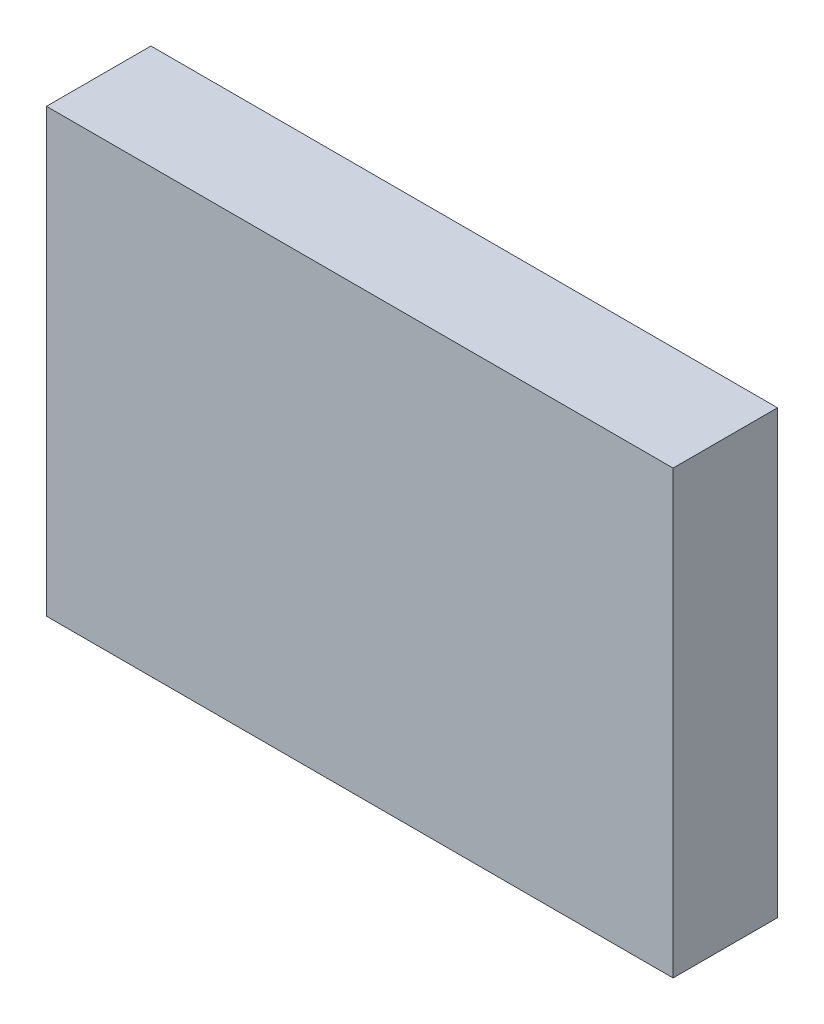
ISO-10303-21;
HEADER;
FILE_DESCRIPTION(('STEP AP214'),'2;1');
FILE_NAME('part.step','',(''),(''),'','','');
FILE_SCHEMA(('AUTOMOTIVE_DESIGN { 1 0 10303 214 1 1 1 1 }'));
ENDSEC;
DATA;
#1=APPLICATION_CONTEXT('core data for automotive mechanical design processes');
#2=APPLICATION_PROTOCOL_DEFINITION('international standard','automotive_design',2000,#1);
#3=PRODUCT_CONTEXT('',#1,'mechanical');
#4=PRODUCT('Part','Part','',(#3));
#5=PRODUCT_RELATED_PRODUCT_CATEGORY('part','',(#4));
#6=PRODUCT_DEFINITION_FORMATION('','',#4);
#7=PRODUCT_DEFINITION_CONTEXT('part definition',#1,'design');
#8=PRODUCT_DEFINITION('design','',#6,#7);
#9=PRODUCT_DEFINITION_SHAPE('','',#8);
#10=(LENGTH_UNIT() NAMED_UNIT(*) SI_UNIT(.MILLI.,.METRE.));
#11=(NAMED_UNIT(*) PLANE_ANGLE_UNIT() SI_UNIT($,.RADIAN.));
#12=(NAMED_UNIT(*) SI_UNIT($,.STERADIAN.) SOLID_ANGLE_UNIT());
#13=UNCERTAINTY_MEASURE_WITH_UNIT(LENGTH_MEASURE(1.E-05),#10,'distance_accuracy_value','');
#14=(GEOMETRIC_REPRESENTATION_CONTEXT(3) GLOBAL_UNCERTAINTY_ASSIGNED_CONTEXT((#13)) GLOBAL_UNIT_ASSIGNED_CONTEXT((#10,
#11,#12)) REPRESENTATION_CONTEXT('',''));
#15=CARTESIAN_POINT('',(0.,0.,0.));
#16=DIRECTION('',(0.,0.,1.));
#17=DIRECTION('',(1.,0.,0.));
#18=AXIS2_PLACEMENT_3D('',#15,#16,#17);
#19=CARTESIAN_POINT('',(0.,0.,35.));
#20=DIRECTION('',(1.,0.,0.));
#21=DIRECTION('',(0.,0.,-1.));
#22=AXIS2_PLACEMENT_3D('',#19,#20,#21);
#23=PLANE('',#22);
#24=DIRECTION('',(0.,-1.,0.));
#25=VECTOR('',#24,1.);
#26=CARTESIAN_POINT('',(0.,0.,0.));
#27=LINE('',#26,#25);
#28=CARTESIAN_POINT('',(0.,148.,0.));
#29=VERTEX_POINT('',#28);
#30=CARTESIAN_POINT('',(0.,0.,0.));
#31=VERTEX_POINT('',#30);
#32=EDGE_CURVE('E94',#29,#31,#27,.T.);
#33=ORIENTED_EDGE('',*,*,#32,.T.);
#34=DIRECTION('',(0.,0.,-1.));
#35=VECTOR('',#34,1.);
#36=CARTESIAN_POINT('',(0.,0.,35.));
#37=LINE('',#36,#35);
#38=CARTESIAN_POINT('',(0.,0.,35.));
#39=VERTEX_POINT('',#38);
#40=EDGE_CURVE('E11',#39,#31,#37,.T.);
#41=ORIENTED_EDGE('',*,*,#40,.F.);
#42=DIRECTION('',(0.,-1.,0.));
#43=VECTOR('',#42,1.);
#44=CARTESIAN_POINT('',(0.,0.,35.));
#45=LINE('',#44,#43);
#46=CARTESIAN_POINT('',(0.,148.,35.));
#47=VERTEX_POINT('',#46);
#48=EDGE_CURVE('E82',#47,#39,#45,.T.);
#49=ORIENTED_EDGE('',*,*,#48,.F.);
#50=DIRECTION('',(0.,0.,-1.));
#51=VECTOR('',#50,1.);
#52=CARTESIAN_POINT('',(0.,148.,35.));
#53=LINE('',#52,#51);
#54=EDGE_CURVE('E90',#47,#29,#53,.T.);
#55=ORIENTED_EDGE('',*,*,#54,.T.);
#56=EDGE_LOOP('',(#33,#41,#49,#55));
#57=FACE_BOUND('',#56,.T.);
#58=ADVANCED_FACE('F31',(#57),#23,.F.);
#59=CARTESIAN_POINT('',(0.,0.,35.));
#60=DIRECTION('',(0.,1.,0.));
#61=DIRECTION('',(0.,0.,1.));
#62=AXIS2_PLACEMENT_3D('',#59,#60,#61);
#63=PLANE('',#62);
#64=DIRECTION('',(1.,0.,0.));
#65=VECTOR('',#64,1.);
#66=CARTESIAN_POINT('',(0.,0.,0.));
#67=LINE('',#66,#65);
#68=CARTESIAN_POINT('',(210.,0.,0.));
#69=VERTEX_POINT('',#68);
#70=EDGE_CURVE('E86',#31,#69,#67,.T.);
#71=ORIENTED_EDGE('',*,*,#70,.T.);
#72=DIRECTION('',(0.,0.,-1.));
#73=VECTOR('',#72,1.);
#74=CARTESIAN_POINT('',(210.,0.,35.));
#75=LINE('',#74,#73);
#76=CARTESIAN_POINT('',(210.,0.,35.));
#77=VERTEX_POINT('',#76);
#78=EDGE_CURVE('E39',#77,#69,#75,.T.);
#79=ORIENTED_EDGE('',*,*,#78,.F.);
#80=DIRECTION('',(1.,0.,0.));
#81=VECTOR('',#80,1.);
#82=CARTESIAN_POINT('',(0.,0.,35.));
#83=LINE('',#82,#81);
#84=EDGE_CURVE('E77',#39,#77,#83,.T.);
#85=ORIENTED_EDGE('',*,*,#84,.F.);
#86=ORIENTED_EDGE('',*,*,#40,.T.);
#87=EDGE_LOOP('',(#71,#79,#85,#86));
#88=FACE_BOUND('',#87,.T.);
#89=ADVANCED_FACE('F85',(#88),#63,.F.);
#90=CARTESIAN_POINT('',(210.,0.,35.));
#91=DIRECTION('',(-1.,0.,0.));
#92=DIRECTION('',(0.,0.,1.));
#93=AXIS2_PLACEMENT_3D('',#90,#91,#92);
#94=PLANE('',#93);
#95=DIRECTION('',(0.,1.,0.));
#96=VECTOR('',#95,1.);
#97=CARTESIAN_POINT('',(210.,0.,0.));
#98=LINE('',#97,#96);
#99=CARTESIAN_POINT('',(210.,148.,0.));
#100=VERTEX_POINT('',#99);
#101=EDGE_CURVE('E64',#69,#100,#98,.T.);
#102=ORIENTED_EDGE('',*,*,#101,.T.);
#103=DIRECTION('',(0.,0.,-1.));
#104=VECTOR('',#103,1.);
#105=CARTESIAN_POINT('',(210.,148.,35.));
#106=LINE('',#105,#104);
#107=CARTESIAN_POINT('',(210.,148.,35.));
#108=VERTEX_POINT('',#107);
#109=EDGE_CURVE('E87',#108,#100,#106,.T.);
#110=ORIENTED_EDGE('',*,*,#109,.F.);
#111=DIRECTION('',(0.,1.,0.));
#112=VECTOR('',#111,1.);
#113=CARTESIAN_POINT('',(210.,0.,35.));
#114=LINE('',#113,#112);
#115=EDGE_CURVE('E80',#77,#108,#114,.T.);
#116=ORIENTED_EDGE('',*,*,#115,.F.);
#117=ORIENTED_EDGE('',*,*,#78,.T.);
#118=EDGE_LOOP('',(#102,#110,#116,#117));
#119=FACE_BOUND('',#118,.T.);
#120=ADVANCED_FACE('F88',(#119),#94,.F.);
#121=CARTESIAN_POINT('',(0.,148.,35.));
#122=DIRECTION('',(0.,-1.,0.));
#123=DIRECTION('',(0.,0.,-1.));
#124=AXIS2_PLACEMENT_3D('',#121,#122,#123);
#125=PLANE('',#124);
#126=DIRECTION('',(-1.,0.,0.));
#127=VECTOR('',#126,1.);
#128=CARTESIAN_POINT('',(0.,148.,0.));
#129=LINE('',#128,#127);
#130=EDGE_CURVE('E70',#100,#29,#129,.T.);
#131=ORIENTED_EDGE('',*,*,#130,.T.);
#132=ORIENTED_EDGE('',*,*,#54,.F.);
#133=DIRECTION('',(-1.,0.,0.));
#134=VECTOR('',#133,1.);
#135=CARTESIAN_POINT('',(0.,148.,35.));
#136=LINE('',#135,#134);
#137=EDGE_CURVE('E47',#108,#47,#136,.T.);
#138=ORIENTED_EDGE('',*,*,#137,.F.);
#139=ORIENTED_EDGE('',*,*,#109,.T.);
#140=EDGE_LOOP('',(#131,#132,#138,#139));
#141=FACE_BOUND('',#140,.T.);
#142=ADVANCED_FACE('F101',(#141),#125,.F.);
#143=CARTESIAN_POINT('',(0.,148.,35.));
#144=DIRECTION('',(0.,0.,-1.));
#145=DIRECTION('',(-1.,0.,0.));
#146=AXIS2_PLACEMENT_3D('',#143,#144,#145);
#147=PLANE('',#146);
#148=ORIENTED_EDGE('',*,*,#48,.T.);
#149=ORIENTED_EDGE('',*,*,#84,.T.);
#150=ORIENTED_EDGE('',*,*,#115,.T.);
#151=ORIENTED_EDGE('',*,*,#137,.T.);
#152=EDGE_LOOP('',(#148,#149,#150,#151));
#153=FACE_BOUND('',#152,.T.);
#154=ADVANCED_FACE('F78',(#153),#147,.F.);
#155=CARTESIAN_POINT('',(0.,148.,0.));
#156=DIRECTION('',(0.,0.,-1.));
#157=DIRECTION('',(-1.,0.,0.));
#158=AXIS2_PLACEMENT_3D('',#155,#156,#157);
#159=PLANE('',#158);
#160=ORIENTED_EDGE('',*,*,#32,.F.);
#161=ORIENTED_EDGE('',*,*,#130,.F.);
#162=ORIENTED_EDGE('',*,*,#101,.F.);
#163=ORIENTED_EDGE('',*,*,#70,.F.);
#164=EDGE_LOOP('',(#160,#161,#162,#163));
#165=FACE_BOUND('',#164,.T.);
#166=ADVANCED_FACE('F104',(#165),#159,.T.);
#167=CLOSED_SHELL('',(#58,#89,#120,#142,#154,#166));
#168=MANIFOLD_SOLID_BREP('B2',#167);
#169=ADVANCED_BREP_SHAPE_REPRESENTATION('',(#18,#168),#14);
#170=SHAPE_DEFINITION_REPRESENTATION(#9,#169);
ENDSEC;
END-ISO-10303-21;
